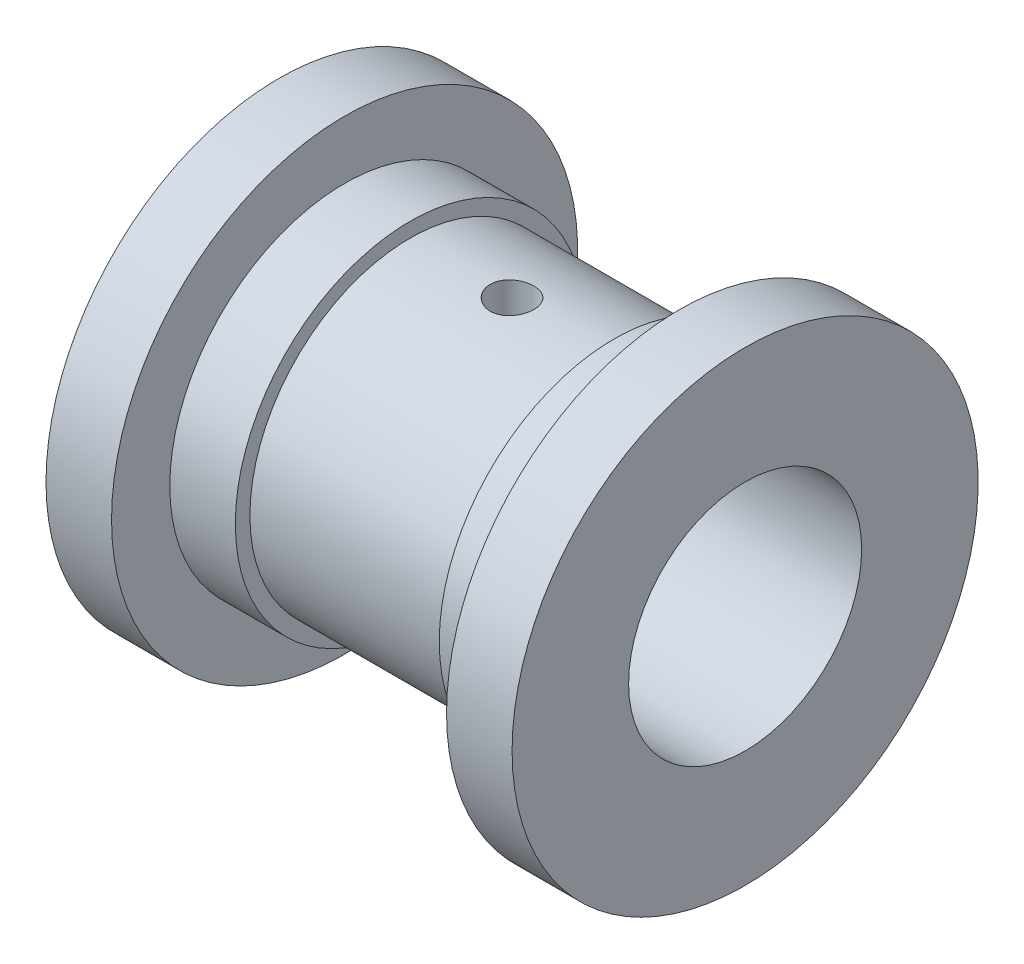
ISO-10303-21;
HEADER;
FILE_DESCRIPTION(('STEP AP214'),'2;1');
FILE_NAME('part.step','',(''),(''),'','','');
FILE_SCHEMA(('AUTOMOTIVE_DESIGN { 1 0 10303 214 1 1 1 1 }'));
ENDSEC;
DATA;
#1=APPLICATION_CONTEXT('core data for automotive mechanical design processes');
#2=APPLICATION_PROTOCOL_DEFINITION('international standard','automotive_design',2000,#1);
#3=PRODUCT_CONTEXT('',#1,'mechanical');
#4=PRODUCT('Part','Part','',(#3));
#5=PRODUCT_RELATED_PRODUCT_CATEGORY('part','',(#4));
#6=PRODUCT_DEFINITION_FORMATION('','',#4);
#7=PRODUCT_DEFINITION_CONTEXT('part definition',#1,'design');
#8=PRODUCT_DEFINITION('design','',#6,#7);
#9=PRODUCT_DEFINITION_SHAPE('','',#8);
#10=(LENGTH_UNIT() NAMED_UNIT(*) SI_UNIT(.MILLI.,.METRE.));
#11=(NAMED_UNIT(*) PLANE_ANGLE_UNIT() SI_UNIT($,.RADIAN.));
#12=(NAMED_UNIT(*) SI_UNIT($,.STERADIAN.) SOLID_ANGLE_UNIT());
#13=UNCERTAINTY_MEASURE_WITH_UNIT(LENGTH_MEASURE(1.E-05),#10,'distance_accuracy_value','');
#14=(GEOMETRIC_REPRESENTATION_CONTEXT(3) GLOBAL_UNCERTAINTY_ASSIGNED_CONTEXT((#13)) GLOBAL_UNIT_ASSIGNED_CONTEXT((#10,
#11,#12)) REPRESENTATION_CONTEXT('',''));
#15=CARTESIAN_POINT('',(0.,0.,0.));
#16=DIRECTION('',(0.,0.,1.));
#17=DIRECTION('',(1.,0.,0.));
#18=AXIS2_PLACEMENT_3D('',#15,#16,#17);
#19=CARTESIAN_POINT('',(-34.2236947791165,0.,0.));
#20=DIRECTION('',(-1.,0.,0.));
#21=DIRECTION('',(0.,0.,1.));
#22=AXIS2_PLACEMENT_3D('',#19,#20,#21);
#23=CYLINDRICAL_SURFACE('',#22,22.);
#24=CARTESIAN_POINT('',(0.,21.7944947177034,-3.));
#25=CARTESIAN_POINT('',(0.167668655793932,21.7944973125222,-2.99999295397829));
#26=CARTESIAN_POINT('',(0.335438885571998,21.7964504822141,-2.98589613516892));
#27=CARTESIAN_POINT('',(0.666300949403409,21.8040481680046,-2.92988930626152));
#28=CARTESIAN_POINT('',(0.829387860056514,21.8096964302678,-2.88795106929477));
#29=CARTESIAN_POINT('',(1.14604557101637,21.8240329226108,-2.77752885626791));
#30=CARTESIAN_POINT('',(1.29962310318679,21.8327189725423,-2.70906391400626));
#31=CARTESIAN_POINT('',(1.59308393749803,21.8521497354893,-2.54757436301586));
#32=CARTESIAN_POINT('',(1.73296937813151,21.8628941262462,-2.4545535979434));
#33=CARTESIAN_POINT('',(1.99602918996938,21.8853107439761,-2.24593261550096));
#34=CARTESIAN_POINT('',(2.11909952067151,21.8969880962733,-2.13020174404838));
#35=CARTESIAN_POINT('',(2.34413561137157,21.9199089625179,-1.87972745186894));
#36=CARTESIAN_POINT('',(2.44610027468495,21.9311524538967,-1.74498304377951));
#37=CARTESIAN_POINT('',(2.62640880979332,21.9519917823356,-1.45964673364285));
#38=CARTESIAN_POINT('',(2.70465775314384,21.9615809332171,-1.30899431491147));
#39=CARTESIAN_POINT('',(2.83470513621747,21.9779746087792,-0.996533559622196));
#40=CARTESIAN_POINT('',(2.88650473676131,21.9847792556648,-0.834725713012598));
#41=CARTESIAN_POINT('',(2.96187006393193,21.9948010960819,-0.505615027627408));
#42=CARTESIAN_POINT('',(2.98560939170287,21.9980403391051,-0.338352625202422));
#43=CARTESIAN_POINT('',(3.00471876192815,22.0006418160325,-0.00218901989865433));
#44=CARTESIAN_POINT('',(3.00009012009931,22.0000042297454,0.166712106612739));
#45=CARTESIAN_POINT('',(2.96273314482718,21.9949416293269,0.500176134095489));
#46=CARTESIAN_POINT('',(2.93019154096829,21.9905417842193,0.664760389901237));
#47=CARTESIAN_POINT('',(2.83822479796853,21.9784771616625,0.986109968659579));
#48=CARTESIAN_POINT('',(2.77879906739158,21.9708123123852,1.1428751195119));
#49=CARTESIAN_POINT('',(2.63455559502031,21.9530355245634,1.44470900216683));
#50=CARTESIAN_POINT('',(2.54965799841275,21.9429159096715,1.58973910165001));
#51=CARTESIAN_POINT('',(2.35693890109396,21.9213599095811,1.86356465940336));
#52=CARTESIAN_POINT('',(2.24911615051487,21.9099234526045,1.99235923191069));
#53=CARTESIAN_POINT('',(2.01256398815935,21.8869019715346,2.23115639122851));
#54=CARTESIAN_POINT('',(1.88367170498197,21.8753164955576,2.34099765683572));
#55=CARTESIAN_POINT('',(1.60919608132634,21.8533940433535,2.53751386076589));
#56=CARTESIAN_POINT('',(1.46361266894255,21.8430570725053,2.62418869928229));
#57=CARTESIAN_POINT('',(1.15973309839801,21.8248023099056,2.77192629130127));
#58=CARTESIAN_POINT('',(1.00142980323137,21.816885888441,2.83297454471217));
#59=CARTESIAN_POINT('',(0.676685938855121,21.8043941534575,2.92757469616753));
#60=CARTESIAN_POINT('',(0.510245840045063,21.7998186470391,2.96112818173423));
#61=CARTESIAN_POINT('',(0.175382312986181,21.7945626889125,2.99956941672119));
#62=CARTESIAN_POINT('',(0.00698549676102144,21.7938512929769,3.00468490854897));
#63=CARTESIAN_POINT('',(-0.32826283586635,21.7963221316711,2.98670732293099));
#64=CARTESIAN_POINT('',(-0.495114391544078,21.7995042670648,2.96361496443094));
#65=CARTESIAN_POINT('',(-0.821843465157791,21.8093753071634,2.89006955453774));
#66=CARTESIAN_POINT('',(-0.981746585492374,21.8160498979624,2.83972815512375));
#67=CARTESIAN_POINT('',(-1.29084344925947,21.8321421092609,2.71322912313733));
#68=CARTESIAN_POINT('',(-1.44003674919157,21.8415598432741,2.63707042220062));
#69=CARTESIAN_POINT('',(-1.72450521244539,21.8621508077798,2.46054424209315));
#70=CARTESIAN_POINT('',(-1.85968743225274,21.8733346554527,2.36002824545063));
#71=CARTESIAN_POINT('',(-2.11134500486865,21.8961649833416,2.13784918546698));
#72=CARTESIAN_POINT('',(-2.22781948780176,21.9078114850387,2.01618513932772));
#73=CARTESIAN_POINT('',(-2.43956305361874,21.9303506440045,1.75416517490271));
#74=CARTESIAN_POINT('',(-2.53468192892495,21.9412376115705,1.61368731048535));
#75=CARTESIAN_POINT('',(-2.6999717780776,21.9609445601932,1.31861563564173));
#76=CARTESIAN_POINT('',(-2.77014333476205,21.9697645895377,1.1640221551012));
#77=CARTESIAN_POINT('',(-2.88330205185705,21.9843187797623,0.845593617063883));
#78=CARTESIAN_POINT('',(-2.92637398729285,21.9900625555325,0.681789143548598));
#79=CARTESIAN_POINT('',(-2.98438601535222,21.9978571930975,0.349189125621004));
#80=CARTESIAN_POINT('',(-2.99932763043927,21.9999082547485,0.180393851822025));
#81=CARTESIAN_POINT('',(-3.00062266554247,22.0000849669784,-0.155933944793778));
#82=CARTESIAN_POINT('',(-2.98720691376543,21.9982423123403,-0.323465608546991));
#83=CARTESIAN_POINT('',(-2.93265946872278,21.9909020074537,-0.653868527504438));
#84=CARTESIAN_POINT('',(-2.89152782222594,21.9854043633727,-0.816739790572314));
#85=CARTESIAN_POINT('',(-2.78279281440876,21.9713688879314,-1.13315387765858));
#86=CARTESIAN_POINT('',(-2.71520266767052,21.9628325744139,-1.28670131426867));
#87=CARTESIAN_POINT('',(-2.55549339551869,21.9436616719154,-1.58031159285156));
#88=CARTESIAN_POINT('',(-2.46337375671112,21.9330270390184,-1.72037415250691));
#89=CARTESIAN_POINT('',(-2.25637442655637,21.9107413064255,-1.98421472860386));
#90=CARTESIAN_POINT('',(-2.14132346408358,21.899082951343,-2.10785776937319));
#91=CARTESIAN_POINT('',(-1.89208624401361,21.8761200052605,-2.33416948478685));
#92=CARTESIAN_POINT('',(-1.75789548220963,21.864815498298,-2.43683320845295));
#93=CARTESIAN_POINT('',(-1.47347030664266,21.8437846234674,-2.61868613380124));
#94=CARTESIAN_POINT('',(-1.32316490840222,21.8340657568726,-2.69776514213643));
#95=CARTESIAN_POINT('',(-1.01135241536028,21.817394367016,-2.8294429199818));
#96=CARTESIAN_POINT('',(-0.84985747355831,21.8104388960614,-2.8820699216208));
#97=CARTESIAN_POINT('',(-0.572977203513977,21.8017355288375,-2.94703203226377));
#98=CARTESIAN_POINT('',(-0.459323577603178,21.7990341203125,-2.96686567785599));
#99=CARTESIAN_POINT('',(-0.230462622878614,21.7954128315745,-2.99335201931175));
#100=CARTESIAN_POINT('',(-0.115255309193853,21.7944929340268,-3.00000484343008));
#101=CARTESIAN_POINT('',(0.,21.7944947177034,-3.));
#102=B_SPLINE_CURVE_WITH_KNOTS('',3,(#24,#25,#26,#27,#28,#29,#30,#31,#32,#33,#34,#35,#36,#37,
#38,#39,#40,#41,#42,#43,#44,#45,#46,#47,#48,#49,#50,#51,#52,#53,#54,#55,#56,#57,#58,#59,#60,#61,
#62,#63,#64,#65,#66,#67,#68,#69,#70,#71,#72,#73,#74,#75,#76,#77,#78,#79,#80,#81,#82,#83,#84,#85,
#86,#87,#88,#89,#90,#91,#92,#93,#94,#95,#96,#97,#98,#99,#100,#101),.UNSPECIFIED.,.T.,.F.,(4,2,2,
2,2,2,2,2,2,2,2,2,2,2,2,2,2,2,2,2,2,2,2,2,2,2,2,2,2,2,2,2,2,2,2,2,2,2,4),(0.,0.502584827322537,
1.00567997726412,1.50841480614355,2.01107098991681,2.5167086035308,3.02237248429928,
3.5300344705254,4.03767417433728,4.54215653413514,5.04661549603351,5.54772586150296,
6.04884725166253,6.55155638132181,7.05429292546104,7.56111742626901,8.06794411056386,
8.57505718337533,9.08214097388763,9.58515792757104,10.0881620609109,10.5891205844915,
11.0900998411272,11.5942142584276,12.0983521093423,12.6059319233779,13.1134998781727,
13.6194720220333,14.125416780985,14.6272590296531,15.1291004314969,15.6306915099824,
16.1322930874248,16.6377918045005,17.1434096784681,17.6513541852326,18.158755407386,
18.5042352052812,18.8497116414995),.UNSPECIFIED.);
#103=CARTESIAN_POINT('',(0.,21.7944947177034,-3.));
#104=VERTEX_POINT('',#103);
#105=EDGE_CURVE('E84',#104,#104,#102,.T.);
#106=ORIENTED_EDGE('',*,*,#105,.T.);
#107=EDGE_LOOP('',(#106));
#108=FACE_BOUND('',#107,.T.);
#109=CARTESIAN_POINT('',(14.,0.,0.));
#110=DIRECTION('',(-1.,0.,0.));
#111=DIRECTION('',(0.,0.,1.));
#112=AXIS2_PLACEMENT_3D('',#109,#110,#111);
#113=CIRCLE('',#112,22.);
#114=CARTESIAN_POINT('',(14.,0.,22.));
#115=VERTEX_POINT('',#114);
#116=EDGE_CURVE('E57',#115,#115,#113,.T.);
#117=ORIENTED_EDGE('',*,*,#116,.T.);
#118=EDGE_LOOP('',(#117));
#119=FACE_BOUND('',#118,.T.);
#120=CARTESIAN_POINT('',(-14.,0.,0.));
#121=DIRECTION('',(-1.,0.,0.));
#122=DIRECTION('',(0.,0.,1.));
#123=AXIS2_PLACEMENT_3D('',#120,#121,#122);
#124=CIRCLE('',#123,22.);
#125=CARTESIAN_POINT('',(-14.,0.,22.));
#126=VERTEX_POINT('',#125);
#127=EDGE_CURVE('E54',#126,#126,#124,.T.);
#128=ORIENTED_EDGE('',*,*,#127,.F.);
#129=EDGE_LOOP('',(#128));
#130=FACE_BOUND('',#129,.T.);
#131=CARTESIAN_POINT('',(0.,-21.6333076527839,-4.));
#132=CARTESIAN_POINT('',(0.22268024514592,-21.6333118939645,-3.99999133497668));
#133=CARTESIAN_POINT('',(0.445474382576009,-21.636783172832,-3.98134200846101));
#134=CARTESIAN_POINT('',(0.884789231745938,-21.650277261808,-3.907282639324));
#135=CARTESIAN_POINT('',(1.10130431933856,-21.6603057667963,-3.85184064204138));
#136=CARTESIAN_POINT('',(1.52164062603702,-21.6857418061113,-3.70594738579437));
#137=CARTESIAN_POINT('',(1.7254731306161,-21.7011444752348,-3.61552778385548));
#138=CARTESIAN_POINT('',(2.11505978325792,-21.7355875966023,-3.40232850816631));
#139=CARTESIAN_POINT('',(2.30081551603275,-21.7546277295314,-3.27955167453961));
#140=CARTESIAN_POINT('',(2.65116689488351,-21.7944494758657,-3.00359049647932));
#141=CARTESIAN_POINT('',(2.8155201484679,-21.8152472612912,-2.85010070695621));
#142=CARTESIAN_POINT('',(3.11629112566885,-21.8560978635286,-2.51773079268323));
#143=CARTESIAN_POINT('',(3.25270706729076,-21.8761506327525,-2.338849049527));
#144=CARTESIAN_POINT('',(3.49465463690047,-21.9134244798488,-1.95918683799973));
#145=CARTESIAN_POINT('',(3.59995853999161,-21.930624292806,-1.75825898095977));
#146=CARTESIAN_POINT('',(3.77522666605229,-21.9600735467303,-1.34119954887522));
#147=CARTESIAN_POINT('',(3.84519362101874,-21.9723233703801,-1.12506915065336));
#148=CARTESIAN_POINT('',(3.94705446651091,-21.9903782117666,-0.686249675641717));
#149=CARTESIAN_POINT('',(3.97935662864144,-21.9962522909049,-0.463658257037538));
#150=CARTESIAN_POINT('',(4.0062423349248,-22.0011316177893,-0.0161429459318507));
#151=CARTESIAN_POINT('',(4.00082890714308,-22.0001374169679,0.208780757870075));
#152=CARTESIAN_POINT('',(3.95275171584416,-21.9914463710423,0.651778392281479));
#153=CARTESIAN_POINT('',(3.91052749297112,-21.9838286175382,0.869901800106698));
#154=CARTESIAN_POINT('',(3.79072160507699,-21.9628349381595,1.29591498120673));
#155=CARTESIAN_POINT('',(3.71313870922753,-21.949458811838,1.5038043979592));
#156=CARTESIAN_POINT('',(3.52439388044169,-21.9183184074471,1.90473245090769));
#157=CARTESIAN_POINT('',(3.41305471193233,-21.9005310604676,2.09768578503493));
#158=CARTESIAN_POINT('',(3.16008822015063,-21.8625379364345,2.46233526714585));
#159=CARTESIAN_POINT('',(3.01845799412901,-21.8423319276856,2.63402937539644));
#160=CARTESIAN_POINT('',(2.70650309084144,-21.8013981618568,2.95388890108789));
#161=CARTESIAN_POINT('',(2.53579396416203,-21.7806670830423,3.10167918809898));
#162=CARTESIAN_POINT('',(2.17181187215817,-21.7412992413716,3.36658543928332));
#163=CARTESIAN_POINT('',(1.97853861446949,-21.7226625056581,3.48370100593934));
#164=CARTESIAN_POINT('',(1.57443497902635,-21.6895894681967,3.68403076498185));
#165=CARTESIAN_POINT('',(1.36357833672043,-21.6751596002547,3.76719310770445));
#166=CARTESIAN_POINT('',(0.930565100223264,-21.6522346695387,3.89680753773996));
#167=CARTESIAN_POINT('',(0.708409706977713,-21.6437389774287,3.94326351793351));
#168=CARTESIAN_POINT('',(0.262480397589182,-21.6337680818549,3.99760435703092));
#169=CARTESIAN_POINT('',(0.0387741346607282,-21.6321950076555,4.00602696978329));
#170=CARTESIAN_POINT('',(-0.40684910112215,-21.6359859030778,3.98550109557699));
#171=CARTESIAN_POINT('',(-0.628766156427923,-21.6413495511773,3.95655434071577));
#172=CARTESIAN_POINT('',(-1.06276068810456,-21.6583185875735,3.86257219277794));
#173=CARTESIAN_POINT('',(-1.27490076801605,-21.6698756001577,3.79781637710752));
#174=CARTESIAN_POINT('',(-1.68531943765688,-21.6978878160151,3.63434995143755));
#175=CARTESIAN_POINT('',(-1.88359705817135,-21.7143433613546,3.53563697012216));
#176=CARTESIAN_POINT('',(-2.26303839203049,-21.7505226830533,3.30581172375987));
#177=CARTESIAN_POINT('',(-2.44399223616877,-21.7702800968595,3.17435835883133));
#178=CARTESIAN_POINT('',(-2.78146738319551,-21.8107413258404,2.88324609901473));
#179=CARTESIAN_POINT('',(-2.93798662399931,-21.8314452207,2.72358482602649));
#180=CARTESIAN_POINT('',(-3.22414569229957,-21.8717797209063,2.37819260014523));
#181=CARTESIAN_POINT('',(-3.3534247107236,-21.8913936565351,2.19216046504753));
#182=CARTESIAN_POINT('',(-3.57889261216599,-21.9270616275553,1.80070523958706));
#183=CARTESIAN_POINT('',(-3.67508271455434,-21.9431157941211,1.5952828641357));
#184=CARTESIAN_POINT('',(-3.83109607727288,-21.9697834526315,1.17189643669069));
#185=CARTESIAN_POINT('',(-3.89109980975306,-21.9804239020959,0.954000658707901));
#186=CARTESIAN_POINT('',(-3.97361468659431,-21.9951799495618,0.511013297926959));
#187=CARTESIAN_POINT('',(-3.99612953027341,-21.9992961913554,0.285922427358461));
#188=CARTESIAN_POINT('',(-4.00290504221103,-22.0005282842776,-0.161599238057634));
#189=CARTESIAN_POINT('',(-3.98771177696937,-21.9977440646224,-0.384021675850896));
#190=CARTESIAN_POINT('',(-3.92069410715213,-21.9856946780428,-0.823089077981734));
#191=CARTESIAN_POINT('',(-3.86887000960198,-21.9764295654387,-1.03973409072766));
#192=CARTESIAN_POINT('',(-3.73028619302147,-21.9524581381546,-1.46083086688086));
#193=CARTESIAN_POINT('',(-3.64358130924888,-21.9377603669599,-1.6653011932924));
#194=CARTESIAN_POINT('',(-3.43776119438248,-21.9045184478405,-2.05687402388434));
#195=CARTESIAN_POINT('',(-3.31864396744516,-21.8859740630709,-2.24397545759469));
#196=CARTESIAN_POINT('',(-3.04948472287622,-21.8467718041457,-2.59822919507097));
#197=CARTESIAN_POINT('',(-2.89904660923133,-21.826088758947,-2.76507779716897));
#198=CARTESIAN_POINT('',(-2.57234096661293,-21.7851034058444,-3.07135244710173));
#199=CARTESIAN_POINT('',(-2.39606738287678,-21.7648011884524,-3.21077204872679));
#200=CARTESIAN_POINT('',(-2.02088064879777,-21.7266856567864,-3.45935343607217));
#201=CARTESIAN_POINT('',(-1.8217855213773,-21.7088952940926,-3.56824417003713));
#202=CARTESIAN_POINT('',(-1.40787344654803,-21.6780923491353,-3.75086117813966));
#203=CARTESIAN_POINT('',(-1.19307181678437,-21.6650751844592,-3.82462119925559));
#204=CARTESIAN_POINT('',(-0.814646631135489,-21.6480562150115,-3.91959792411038));
#205=CARTESIAN_POINT('',(-0.65326147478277,-21.642557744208,-3.94969798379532));
#206=CARTESIAN_POINT('',(-0.327938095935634,-21.6351819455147,-3.98990196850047));
#207=CARTESIAN_POINT('',(-0.163999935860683,-21.6333045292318,-4.00000638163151));
#208=CARTESIAN_POINT('',(0.,-21.6333076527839,-4.));
#209=B_SPLINE_CURVE_WITH_KNOTS('',3,(#131,#132,#133,#134,#135,#136,#137,#138,#139,#140,#141,
#142,#143,#144,#145,#146,#147,#148,#149,#150,#151,#152,#153,#154,#155,#156,#157,#158,#159,#160,
#161,#162,#163,#164,#165,#166,#167,#168,#169,#170,#171,#172,#173,#174,#175,#176,#177,#178,#179,
#180,#181,#182,#183,#184,#185,#186,#187,#188,#189,#190,#191,#192,#193,#194,#195,#196,#197,#198,
#199,#200,#201,#202,#203,#204,#205,#206,#207,#208),.UNSPECIFIED.,.T.,.F.,(4,2,2,2,2,2,2,2,2,2,2,
2,2,2,2,2,2,2,2,2,2,2,2,2,2,2,2,2,2,2,2,2,2,2,2,2,2,2,4),(0.,0.667440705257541,1.33546184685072,
2.00287979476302,2.67023918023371,3.34459870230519,4.01900122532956,4.69822425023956,
5.37739475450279,6.04913278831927,6.7208168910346,7.38458890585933,8.04838402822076,
8.71572656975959,9.38313309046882,10.0601670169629,10.7372097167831,11.4152824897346,
12.0932833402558,12.7616672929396,13.4300202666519,14.0932273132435,14.7564806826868,
15.4269564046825,16.0974886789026,16.7764104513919,17.4553072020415,18.1307894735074,
18.8062050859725,19.4718969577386,20.1375832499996,20.8022270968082,21.4669118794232,
22.1405775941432,22.8144014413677,23.4940309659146,24.1730063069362,24.6645762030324,
25.1561340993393),.UNSPECIFIED.);
#210=CARTESIAN_POINT('',(0.,-21.6333076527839,-4.));
#211=VERTEX_POINT('',#210);
#212=EDGE_CURVE('E10',#211,#211,#209,.T.);
#213=ORIENTED_EDGE('',*,*,#212,.F.);
#214=EDGE_LOOP('',(#213));
#215=FACE_BOUND('',#214,.T.);
#216=ADVANCED_FACE('F30',(#108,#119,#130,#215),#23,.T.);
#217=CARTESIAN_POINT('',(-34.2236947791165,0.,0.));
#218=DIRECTION('',(-1.,0.,0.));
#219=DIRECTION('',(0.,0.,1.));
#220=AXIS2_PLACEMENT_3D('',#217,#218,#219);
#221=CYLINDRICAL_SURFACE('',#220,32.);
#222=CARTESIAN_POINT('',(-32.,0.,0.));
#223=DIRECTION('',(-1.,0.,0.));
#224=DIRECTION('',(0.,0.,1.));
#225=AXIS2_PLACEMENT_3D('',#222,#223,#224);
#226=CIRCLE('',#225,32.);
#227=CARTESIAN_POINT('',(-32.,0.,32.));
#228=VERTEX_POINT('',#227);
#229=EDGE_CURVE('E78',#228,#228,#226,.T.);
#230=ORIENTED_EDGE('',*,*,#229,.F.);
#231=EDGE_LOOP('',(#230));
#232=FACE_BOUND('',#231,.T.);
#233=CARTESIAN_POINT('',(-23.,0.,0.));
#234=DIRECTION('',(-1.,0.,0.));
#235=DIRECTION('',(0.,0.,1.));
#236=AXIS2_PLACEMENT_3D('',#233,#234,#235);
#237=CIRCLE('',#236,32.);
#238=CARTESIAN_POINT('',(-23.,0.,32.));
#239=VERTEX_POINT('',#238);
#240=EDGE_CURVE('E41',#239,#239,#237,.T.);
#241=ORIENTED_EDGE('',*,*,#240,.T.);
#242=EDGE_LOOP('',(#241));
#243=FACE_BOUND('',#242,.T.);
#244=ADVANCED_FACE('F32',(#232,#243),#221,.T.);
#245=CARTESIAN_POINT('',(-23.,32.,0.));
#246=DIRECTION('',(-1.,0.,0.));
#247=DIRECTION('',(0.,0.,1.));
#248=AXIS2_PLACEMENT_3D('',#245,#246,#247);
#249=PLANE('',#248);
#250=ORIENTED_EDGE('',*,*,#240,.F.);
#251=EDGE_LOOP('',(#250));
#252=FACE_BOUND('',#251,.T.);
#253=CARTESIAN_POINT('',(-23.,0.,0.));
#254=DIRECTION('',(-1.,0.,0.));
#255=DIRECTION('',(0.,0.,1.));
#256=AXIS2_PLACEMENT_3D('',#253,#254,#255);
#257=CIRCLE('',#256,24.);
#258=CARTESIAN_POINT('',(-23.,0.,24.));
#259=VERTEX_POINT('',#258);
#260=EDGE_CURVE('E45',#259,#259,#257,.T.);
#261=ORIENTED_EDGE('',*,*,#260,.T.);
#262=EDGE_LOOP('',(#261));
#263=FACE_BOUND('',#262,.T.);
#264=ADVANCED_FACE('F152',(#252,#263),#249,.F.);
#265=CARTESIAN_POINT('',(-34.2236947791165,0.,0.));
#266=DIRECTION('',(-1.,0.,0.));
#267=DIRECTION('',(0.,0.,1.));
#268=AXIS2_PLACEMENT_3D('',#265,#266,#267);
#269=CYLINDRICAL_SURFACE('',#268,24.);
#270=ORIENTED_EDGE('',*,*,#260,.F.);
#271=EDGE_LOOP('',(#270));
#272=FACE_BOUND('',#271,.T.);
#273=CARTESIAN_POINT('',(-14.,0.,0.));
#274=DIRECTION('',(-1.,0.,0.));
#275=DIRECTION('',(0.,0.,1.));
#276=AXIS2_PLACEMENT_3D('',#273,#274,#275);
#277=CIRCLE('',#276,24.);
#278=CARTESIAN_POINT('',(-14.,0.,24.));
#279=VERTEX_POINT('',#278);
#280=EDGE_CURVE('E49',#279,#279,#277,.T.);
#281=ORIENTED_EDGE('',*,*,#280,.T.);
#282=EDGE_LOOP('',(#281));
#283=FACE_BOUND('',#282,.T.);
#284=ADVANCED_FACE('F143',(#272,#283),#269,.T.);
#285=CARTESIAN_POINT('',(-14.,24.,0.));
#286=DIRECTION('',(-1.,0.,0.));
#287=DIRECTION('',(0.,0.,1.));
#288=AXIS2_PLACEMENT_3D('',#285,#286,#287);
#289=PLANE('',#288);
#290=ORIENTED_EDGE('',*,*,#280,.F.);
#291=EDGE_LOOP('',(#290));
#292=FACE_BOUND('',#291,.T.);
#293=ORIENTED_EDGE('',*,*,#127,.T.);
#294=EDGE_LOOP('',(#293));
#295=FACE_BOUND('',#294,.T.);
#296=ADVANCED_FACE('F138',(#292,#295),#289,.F.);
#297=CARTESIAN_POINT('',(14.,24.,0.));
#298=DIRECTION('',(1.,0.,0.));
#299=DIRECTION('',(0.,0.,-1.));
#300=AXIS2_PLACEMENT_3D('',#297,#298,#299);
#301=PLANE('',#300);
#302=ORIENTED_EDGE('',*,*,#116,.F.);
#303=EDGE_LOOP('',(#302));
#304=FACE_BOUND('',#303,.T.);
#305=CARTESIAN_POINT('',(14.,0.,0.));
#306=DIRECTION('',(-1.,0.,0.));
#307=DIRECTION('',(0.,0.,1.));
#308=AXIS2_PLACEMENT_3D('',#305,#306,#307);
#309=CIRCLE('',#308,24.);
#310=CARTESIAN_POINT('',(14.,0.,24.));
#311=VERTEX_POINT('',#310);
#312=EDGE_CURVE('E60',#311,#311,#309,.T.);
#313=ORIENTED_EDGE('',*,*,#312,.T.);
#314=EDGE_LOOP('',(#313));
#315=FACE_BOUND('',#314,.T.);
#316=ADVANCED_FACE('F135',(#304,#315),#301,.F.);
#317=CARTESIAN_POINT('',(-34.2236947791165,0.,0.));
#318=DIRECTION('',(-1.,0.,0.));
#319=DIRECTION('',(0.,0.,1.));
#320=AXIS2_PLACEMENT_3D('',#317,#318,#319);
#321=CYLINDRICAL_SURFACE('',#320,24.);
#322=ORIENTED_EDGE('',*,*,#312,.F.);
#323=EDGE_LOOP('',(#322));
#324=FACE_BOUND('',#323,.T.);
#325=CARTESIAN_POINT('',(23.,0.,0.));
#326=DIRECTION('',(-1.,0.,0.));
#327=DIRECTION('',(0.,0.,1.));
#328=AXIS2_PLACEMENT_3D('',#325,#326,#327);
#329=CIRCLE('',#328,24.);
#330=CARTESIAN_POINT('',(23.,0.,24.));
#331=VERTEX_POINT('',#330);
#332=EDGE_CURVE('E63',#331,#331,#329,.T.);
#333=ORIENTED_EDGE('',*,*,#332,.T.);
#334=EDGE_LOOP('',(#333));
#335=FACE_BOUND('',#334,.T.);
#336=ADVANCED_FACE('F132',(#324,#335),#321,.T.);
#337=CARTESIAN_POINT('',(23.,32.,0.));
#338=DIRECTION('',(1.,0.,0.));
#339=DIRECTION('',(0.,0.,-1.));
#340=AXIS2_PLACEMENT_3D('',#337,#338,#339);
#341=PLANE('',#340);
#342=ORIENTED_EDGE('',*,*,#332,.F.);
#343=EDGE_LOOP('',(#342));
#344=FACE_BOUND('',#343,.T.);
#345=CARTESIAN_POINT('',(23.,0.,0.));
#346=DIRECTION('',(-1.,0.,0.));
#347=DIRECTION('',(0.,0.,1.));
#348=AXIS2_PLACEMENT_3D('',#345,#346,#347);
#349=CIRCLE('',#348,32.);
#350=CARTESIAN_POINT('',(23.,0.,32.));
#351=VERTEX_POINT('',#350);
#352=EDGE_CURVE('E66',#351,#351,#349,.T.);
#353=ORIENTED_EDGE('',*,*,#352,.T.);
#354=EDGE_LOOP('',(#353));
#355=FACE_BOUND('',#354,.T.);
#356=ADVANCED_FACE('F128',(#344,#355),#341,.F.);
#357=CARTESIAN_POINT('',(-34.2236947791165,0.,0.));
#358=DIRECTION('',(-1.,0.,0.));
#359=DIRECTION('',(0.,0.,1.));
#360=AXIS2_PLACEMENT_3D('',#357,#358,#359);
#361=CYLINDRICAL_SURFACE('',#360,32.);
#362=ORIENTED_EDGE('',*,*,#352,.F.);
#363=EDGE_LOOP('',(#362));
#364=FACE_BOUND('',#363,.T.);
#365=CARTESIAN_POINT('',(32.,0.,0.));
#366=DIRECTION('',(-1.,0.,0.));
#367=DIRECTION('',(0.,0.,1.));
#368=AXIS2_PLACEMENT_3D('',#365,#366,#367);
#369=CIRCLE('',#368,32.);
#370=CARTESIAN_POINT('',(32.,0.,32.));
#371=VERTEX_POINT('',#370);
#372=EDGE_CURVE('E69',#371,#371,#369,.T.);
#373=ORIENTED_EDGE('',*,*,#372,.T.);
#374=EDGE_LOOP('',(#373));
#375=FACE_BOUND('',#374,.T.);
#376=ADVANCED_FACE('F124',(#364,#375),#361,.T.);
#377=CARTESIAN_POINT('',(32.,16.,0.));
#378=DIRECTION('',(-1.,0.,0.));
#379=DIRECTION('',(0.,0.,1.));
#380=AXIS2_PLACEMENT_3D('',#377,#378,#379);
#381=PLANE('',#380);
#382=ORIENTED_EDGE('',*,*,#372,.F.);
#383=EDGE_LOOP('',(#382));
#384=FACE_BOUND('',#383,.T.);
#385=CARTESIAN_POINT('',(32.,0.,0.));
#386=DIRECTION('',(-1.,0.,0.));
#387=DIRECTION('',(0.,0.,1.));
#388=AXIS2_PLACEMENT_3D('',#385,#386,#387);
#389=CIRCLE('',#388,16.);
#390=CARTESIAN_POINT('',(32.,0.,16.));
#391=VERTEX_POINT('',#390);
#392=EDGE_CURVE('E72',#391,#391,#389,.T.);
#393=ORIENTED_EDGE('',*,*,#392,.T.);
#394=EDGE_LOOP('',(#393));
#395=FACE_BOUND('',#394,.T.);
#396=ADVANCED_FACE('F119',(#384,#395),#381,.F.);
#397=CARTESIAN_POINT('',(-34.2236947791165,0.,0.));
#398=DIRECTION('',(-1.,0.,0.));
#399=DIRECTION('',(0.,0.,1.));
#400=AXIS2_PLACEMENT_3D('',#397,#398,#399);
#401=CYLINDRICAL_SURFACE('',#400,16.);
#402=CARTESIAN_POINT('',(0.,15.7162336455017,-3.));
#403=CARTESIAN_POINT('',(-0.166914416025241,15.7162368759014,-2.99999359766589));
#404=CARTESIAN_POINT('',(-0.333911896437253,15.7189215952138,-2.98602252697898));
#405=CARTESIAN_POINT('',(-0.663197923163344,15.7293570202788,-2.93054506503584));
#406=CARTESIAN_POINT('',(-0.825482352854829,15.7371120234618,-2.88901531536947));
#407=CARTESIAN_POINT('',(-1.14053014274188,15.7567795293,-2.77974071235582));
#408=CARTESIAN_POINT('',(-1.29330221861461,15.7686881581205,-2.7120202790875));
#409=CARTESIAN_POINT('',(-1.58530711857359,15.7953165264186,-2.5523513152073));
#410=CARTESIAN_POINT('',(-1.72454099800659,15.8100360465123,-2.46040467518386));
#411=CARTESIAN_POINT('',(-1.98726039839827,15.8408322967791,-2.25367357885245));
#412=CARTESIAN_POINT('',(-2.11055296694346,15.8569223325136,-2.13864585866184));
#413=CARTESIAN_POINT('',(-2.33620877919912,15.8885291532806,-1.8895435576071));
#414=CARTESIAN_POINT('',(-2.43857064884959,15.904045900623,-1.75546772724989));
#415=CARTESIAN_POINT('',(-2.62019875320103,15.9329003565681,-1.47080778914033));
#416=CARTESIAN_POINT('',(-2.69928306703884,15.9462205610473,-1.32010568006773));
#417=CARTESIAN_POINT('',(-2.83093908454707,15.9690321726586,-1.00726256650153));
#418=CARTESIAN_POINT('',(-2.88351296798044,15.9785238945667,-0.845122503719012));
#419=CARTESIAN_POINT('',(-2.96005909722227,15.9925151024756,-0.516005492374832));
#420=CARTESIAN_POINT('',(-2.98435661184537,15.9970713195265,-0.349106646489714));
#421=CARTESIAN_POINT('',(-3.0046737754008,16.0008736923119,-0.013543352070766));
#422=CARTESIAN_POINT('',(-3.00069583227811,16.0001203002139,0.155120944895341));
#423=CARTESIAN_POINT('',(-2.9648244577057,15.9934326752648,0.487196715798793));
#424=CARTESIAN_POINT('',(-2.93328126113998,15.9875634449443,0.650647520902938));
#425=CARTESIAN_POINT('',(-2.84372870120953,15.9713765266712,0.969894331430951));
#426=CARTESIAN_POINT('',(-2.78571837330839,15.9610586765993,1.12569005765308));
#427=CARTESIAN_POINT('',(-2.6445445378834,15.9370252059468,1.42622013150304));
#428=CARTESIAN_POINT('',(-2.56124102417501,15.9232907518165,1.57088714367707));
#429=CARTESIAN_POINT('',(-2.37194866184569,15.893942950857,1.84431995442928));
#430=CARTESIAN_POINT('',(-2.26595750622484,15.8783294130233,1.97308413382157));
#431=CARTESIAN_POINT('',(-2.03236859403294,15.8466702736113,2.21313123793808));
#432=CARTESIAN_POINT('',(-1.90446443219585,15.8306217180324,2.32411581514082));
#433=CARTESIAN_POINT('',(-1.63170093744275,15.8001301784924,2.52310343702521));
#434=CARTESIAN_POINT('',(-1.48684135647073,15.785687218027,2.61110614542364));
#435=CARTESIAN_POINT('',(-1.18388345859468,15.7600378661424,2.76171704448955));
#436=CARTESIAN_POINT('',(-1.02576308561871,15.7488370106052,2.82428187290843));
#437=CARTESIAN_POINT('',(-0.700997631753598,15.7310248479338,2.92187313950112));
#438=CARTESIAN_POINT('',(-0.534353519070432,15.7244130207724,2.95690269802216));
#439=CARTESIAN_POINT('',(-0.199961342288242,15.7166304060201,2.99799345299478));
#440=CARTESIAN_POINT('',(-0.03226776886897,15.7153791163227,3.00448328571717));
#441=CARTESIAN_POINT('',(0.301806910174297,15.7182438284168,2.98945937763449));
#442=CARTESIAN_POINT('',(0.468188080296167,15.7223595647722,2.96794702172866));
#443=CARTESIAN_POINT('',(0.793505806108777,15.7354196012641,2.89789736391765));
#444=CARTESIAN_POINT('',(0.952492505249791,15.7443237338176,2.84958477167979));
#445=CARTESIAN_POINT('',(1.26011437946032,15.7659226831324,2.7275444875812));
#446=CARTESIAN_POINT('',(1.40874879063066,15.7786177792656,2.6538149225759));
#447=CARTESIAN_POINT('',(1.69333523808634,15.8065515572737,2.4820470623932));
#448=CARTESIAN_POINT('',(1.82912107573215,15.8218179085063,2.38373799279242));
#449=CARTESIAN_POINT('',(2.08242408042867,15.853096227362,2.16596688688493));
#450=CARTESIAN_POINT('',(2.19993960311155,15.8691082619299,2.04650294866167));
#451=CARTESIAN_POINT('',(2.41496752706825,15.9003324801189,1.78789883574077));
#452=CARTESIAN_POINT('',(2.51219165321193,15.9155311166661,1.64851706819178));
#453=CARTESIAN_POINT('',(2.68184241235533,15.943188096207,1.35514904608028));
#454=CARTESIAN_POINT('',(2.75427000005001,15.9556465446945,1.20116335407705));
#455=CARTESIAN_POINT('',(2.87184019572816,15.9763611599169,0.883755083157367));
#456=CARTESIAN_POINT('',(2.91712437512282,15.9846390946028,0.720386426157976));
#457=CARTESIAN_POINT('',(2.97957409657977,15.9961528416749,0.388192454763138));
#458=CARTESIAN_POINT('',(2.99674259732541,15.9993891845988,0.219367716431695));
#459=CARTESIAN_POINT('',(3.0023706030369,16.0004445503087,-0.116181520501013));
#460=CARTESIAN_POINT('',(2.9912655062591,15.9983457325,-0.282898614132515));
#461=CARTESIAN_POINT('',(2.94161514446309,15.9891373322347,-0.612046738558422));
#462=CARTESIAN_POINT('',(2.90307014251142,15.9820277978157,-0.774477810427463));
#463=CARTESIAN_POINT('',(2.79981758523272,15.9635967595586,-1.09021295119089));
#464=CARTESIAN_POINT('',(2.73515637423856,15.9522827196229,-1.24353263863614));
#465=CARTESIAN_POINT('',(2.58155909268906,15.9266674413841,-1.5372112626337));
#466=CARTESIAN_POINT('',(2.49262139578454,15.912366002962,-1.67756933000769));
#467=CARTESIAN_POINT('',(2.29149709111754,15.882095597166,-1.94351005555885));
#468=CARTESIAN_POINT('',(2.17899593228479,15.8661056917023,-2.06885247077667));
#469=CARTESIAN_POINT('',(1.93459087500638,15.8343926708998,-2.2990307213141));
#470=CARTESIAN_POINT('',(1.80268241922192,15.8186696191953,-2.40386172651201));
#471=CARTESIAN_POINT('',(1.52174709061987,15.7891115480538,-2.59095267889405));
#472=CARTESIAN_POINT('',(1.37257312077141,15.7752953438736,-2.67299481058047));
#473=CARTESIAN_POINT('',(1.06234842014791,15.7513416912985,-2.81072264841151));
#474=CARTESIAN_POINT('',(0.901309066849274,15.7412007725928,-2.86643323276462));
#475=CARTESIAN_POINT('',(0.616495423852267,15.7278603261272,-2.9385945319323));
#476=CARTESIAN_POINT('',(0.494388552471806,15.7235262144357,-2.96158211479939));
#477=CARTESIAN_POINT('',(0.248203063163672,15.7177117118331,-2.99228702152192));
#478=CARTESIAN_POINT('',(0.124124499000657,15.7162312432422,-3.00000476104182));
#479=CARTESIAN_POINT('',(0.,15.7162336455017,-3.));
#480=B_SPLINE_CURVE_WITH_KNOTS('',3,(#402,#403,#404,#405,#406,#407,#408,#409,#410,#411,#412,
#413,#414,#415,#416,#417,#418,#419,#420,#421,#422,#423,#424,#425,#426,#427,#428,#429,#430,#431,
#432,#433,#434,#435,#436,#437,#438,#439,#440,#441,#442,#443,#444,#445,#446,#447,#448,#449,#450,
#451,#452,#453,#454,#455,#456,#457,#458,#459,#460,#461,#462,#463,#464,#465,#466,#467,#468,#469,
#470,#471,#472,#473,#474,#475,#476,#477,#478,#479),.UNSPECIFIED.,.T.,.F.,(4,2,2,2,2,2,2,2,2,2,2,
2,2,2,2,2,2,2,2,2,2,2,2,2,2,2,2,2,2,2,2,2,2,2,2,2,2,2,4),(0.,0.500289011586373,1.00100260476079,
1.50125045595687,2.00145927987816,2.50724671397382,3.01306734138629,3.52274208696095,
4.03237491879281,4.53608550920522,5.03975320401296,5.53711301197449,6.03449094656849,
6.53467383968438,7.03490761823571,7.54281229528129,8.050724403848,8.55949872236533,
9.06821537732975,9.5692649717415,10.0702897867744,10.5671758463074,11.0640985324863,
11.5667572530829,12.0694611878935,12.5788825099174,13.0882842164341,13.5950053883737,
14.1016732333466,14.6005860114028,15.0994940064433,15.5975205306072,16.0955804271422,
16.6007692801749,17.1060769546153,17.6160600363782,18.1255603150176,18.4976061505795,
18.8696418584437),.UNSPECIFIED.);
#481=CARTESIAN_POINT('',(0.,15.7162336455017,-3.));
#482=VERTEX_POINT('',#481);
#483=EDGE_CURVE('E90',#482,#482,#480,.T.);
#484=ORIENTED_EDGE('',*,*,#483,.T.);
#485=EDGE_LOOP('',(#484));
#486=FACE_BOUND('',#485,.T.);
#487=CARTESIAN_POINT('',(0.,-15.7162336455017,-3.));
#488=CARTESIAN_POINT('',(0.166914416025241,-15.7162368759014,-2.99999359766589));
#489=CARTESIAN_POINT('',(0.333911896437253,-15.7189215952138,-2.98602252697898));
#490=CARTESIAN_POINT('',(0.663197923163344,-15.7293570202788,-2.93054506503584));
#491=CARTESIAN_POINT('',(0.825482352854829,-15.7371120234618,-2.88901531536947));
#492=CARTESIAN_POINT('',(1.14053014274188,-15.7567795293,-2.77974071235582));
#493=CARTESIAN_POINT('',(1.29330221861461,-15.7686881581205,-2.7120202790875));
#494=CARTESIAN_POINT('',(1.58530711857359,-15.7953165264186,-2.5523513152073));
#495=CARTESIAN_POINT('',(1.72454099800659,-15.8100360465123,-2.46040467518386));
#496=CARTESIAN_POINT('',(1.98726039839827,-15.8408322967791,-2.25367357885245));
#497=CARTESIAN_POINT('',(2.11055296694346,-15.8569223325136,-2.13864585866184));
#498=CARTESIAN_POINT('',(2.33620877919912,-15.8885291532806,-1.8895435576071));
#499=CARTESIAN_POINT('',(2.43857064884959,-15.904045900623,-1.75546772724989));
#500=CARTESIAN_POINT('',(2.62019875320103,-15.9329003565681,-1.47080778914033));
#501=CARTESIAN_POINT('',(2.69928306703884,-15.9462205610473,-1.32010568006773));
#502=CARTESIAN_POINT('',(2.83093908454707,-15.9690321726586,-1.00726256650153));
#503=CARTESIAN_POINT('',(2.88351296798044,-15.9785238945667,-0.845122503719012));
#504=CARTESIAN_POINT('',(2.96005909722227,-15.9925151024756,-0.516005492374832));
#505=CARTESIAN_POINT('',(2.98435661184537,-15.9970713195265,-0.349106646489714));
#506=CARTESIAN_POINT('',(3.0046737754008,-16.0008736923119,-0.013543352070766));
#507=CARTESIAN_POINT('',(3.00069583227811,-16.0001203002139,0.155120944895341));
#508=CARTESIAN_POINT('',(2.9648244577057,-15.9934326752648,0.487196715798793));
#509=CARTESIAN_POINT('',(2.93328126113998,-15.9875634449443,0.650647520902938));
#510=CARTESIAN_POINT('',(2.84372870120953,-15.9713765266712,0.969894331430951));
#511=CARTESIAN_POINT('',(2.78571837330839,-15.9610586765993,1.12569005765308));
#512=CARTESIAN_POINT('',(2.6445445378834,-15.9370252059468,1.42622013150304));
#513=CARTESIAN_POINT('',(2.56124102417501,-15.9232907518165,1.57088714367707));
#514=CARTESIAN_POINT('',(2.37194866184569,-15.893942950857,1.84431995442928));
#515=CARTESIAN_POINT('',(2.26595750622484,-15.8783294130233,1.97308413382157));
#516=CARTESIAN_POINT('',(2.03236859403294,-15.8466702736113,2.21313123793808));
#517=CARTESIAN_POINT('',(1.90446443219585,-15.8306217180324,2.32411581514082));
#518=CARTESIAN_POINT('',(1.63170093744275,-15.8001301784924,2.52310343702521));
#519=CARTESIAN_POINT('',(1.48684135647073,-15.785687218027,2.61110614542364));
#520=CARTESIAN_POINT('',(1.18388345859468,-15.7600378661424,2.76171704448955));
#521=CARTESIAN_POINT('',(1.02576308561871,-15.7488370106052,2.82428187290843));
#522=CARTESIAN_POINT('',(0.700997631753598,-15.7310248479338,2.92187313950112));
#523=CARTESIAN_POINT('',(0.534353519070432,-15.7244130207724,2.95690269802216));
#524=CARTESIAN_POINT('',(0.199961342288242,-15.7166304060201,2.99799345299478));
#525=CARTESIAN_POINT('',(0.03226776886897,-15.7153791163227,3.00448328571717));
#526=CARTESIAN_POINT('',(-0.301806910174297,-15.7182438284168,2.98945937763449));
#527=CARTESIAN_POINT('',(-0.468188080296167,-15.7223595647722,2.96794702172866));
#528=CARTESIAN_POINT('',(-0.793505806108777,-15.7354196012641,2.89789736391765));
#529=CARTESIAN_POINT('',(-0.952492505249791,-15.7443237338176,2.84958477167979));
#530=CARTESIAN_POINT('',(-1.26011437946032,-15.7659226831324,2.7275444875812));
#531=CARTESIAN_POINT('',(-1.40874879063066,-15.7786177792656,2.6538149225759));
#532=CARTESIAN_POINT('',(-1.69333523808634,-15.8065515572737,2.4820470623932));
#533=CARTESIAN_POINT('',(-1.82912107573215,-15.8218179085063,2.38373799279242));
#534=CARTESIAN_POINT('',(-2.08242408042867,-15.853096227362,2.16596688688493));
#535=CARTESIAN_POINT('',(-2.19993960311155,-15.8691082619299,2.04650294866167));
#536=CARTESIAN_POINT('',(-2.41496752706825,-15.9003324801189,1.78789883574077));
#537=CARTESIAN_POINT('',(-2.51219165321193,-15.9155311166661,1.64851706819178));
#538=CARTESIAN_POINT('',(-2.68184241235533,-15.943188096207,1.35514904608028));
#539=CARTESIAN_POINT('',(-2.75427000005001,-15.9556465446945,1.20116335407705));
#540=CARTESIAN_POINT('',(-2.87184019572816,-15.9763611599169,0.883755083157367));
#541=CARTESIAN_POINT('',(-2.91712437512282,-15.9846390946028,0.720386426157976));
#542=CARTESIAN_POINT('',(-2.97957409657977,-15.9961528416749,0.388192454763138));
#543=CARTESIAN_POINT('',(-2.99674259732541,-15.9993891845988,0.219367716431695));
#544=CARTESIAN_POINT('',(-3.0023706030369,-16.0004445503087,-0.116181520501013));
#545=CARTESIAN_POINT('',(-2.9912655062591,-15.9983457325,-0.282898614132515));
#546=CARTESIAN_POINT('',(-2.94161514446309,-15.9891373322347,-0.612046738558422));
#547=CARTESIAN_POINT('',(-2.90307014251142,-15.9820277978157,-0.774477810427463));
#548=CARTESIAN_POINT('',(-2.79981758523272,-15.9635967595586,-1.09021295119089));
#549=CARTESIAN_POINT('',(-2.73515637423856,-15.9522827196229,-1.24353263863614));
#550=CARTESIAN_POINT('',(-2.58155909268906,-15.9266674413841,-1.5372112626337));
#551=CARTESIAN_POINT('',(-2.49262139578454,-15.912366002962,-1.67756933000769));
#552=CARTESIAN_POINT('',(-2.29149709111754,-15.882095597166,-1.94351005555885));
#553=CARTESIAN_POINT('',(-2.17899593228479,-15.8661056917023,-2.06885247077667));
#554=CARTESIAN_POINT('',(-1.93459087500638,-15.8343926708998,-2.2990307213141));
#555=CARTESIAN_POINT('',(-1.80268241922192,-15.8186696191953,-2.40386172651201));
#556=CARTESIAN_POINT('',(-1.52174709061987,-15.7891115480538,-2.59095267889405));
#557=CARTESIAN_POINT('',(-1.37257312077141,-15.7752953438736,-2.67299481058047));
#558=CARTESIAN_POINT('',(-1.06234842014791,-15.7513416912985,-2.81072264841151));
#559=CARTESIAN_POINT('',(-0.901309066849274,-15.7412007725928,-2.86643323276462));
#560=CARTESIAN_POINT('',(-0.616495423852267,-15.7278603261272,-2.9385945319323));
#561=CARTESIAN_POINT('',(-0.494388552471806,-15.7235262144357,-2.96158211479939));
#562=CARTESIAN_POINT('',(-0.248203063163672,-15.7177117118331,-2.99228702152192));
#563=CARTESIAN_POINT('',(-0.124124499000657,-15.7162312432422,-3.00000476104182));
#564=CARTESIAN_POINT('',(0.,-15.7162336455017,-3.));
#565=B_SPLINE_CURVE_WITH_KNOTS('',3,(#487,#488,#489,#490,#491,#492,#493,#494,#495,#496,#497,
#498,#499,#500,#501,#502,#503,#504,#505,#506,#507,#508,#509,#510,#511,#512,#513,#514,#515,#516,
#517,#518,#519,#520,#521,#522,#523,#524,#525,#526,#527,#528,#529,#530,#531,#532,#533,#534,#535,
#536,#537,#538,#539,#540,#541,#542,#543,#544,#545,#546,#547,#548,#549,#550,#551,#552,#553,#554,
#555,#556,#557,#558,#559,#560,#561,#562,#563,#564),.UNSPECIFIED.,.T.,.F.,(4,2,2,2,2,2,2,2,2,2,2,
2,2,2,2,2,2,2,2,2,2,2,2,2,2,2,2,2,2,2,2,2,2,2,2,2,2,2,4),(0.,0.500289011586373,1.00100260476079,
1.50125045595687,2.00145927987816,2.50724671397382,3.01306734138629,3.52274208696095,
4.03237491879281,4.53608550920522,5.03975320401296,5.53711301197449,6.03449094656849,
6.53467383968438,7.03490761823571,7.54281229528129,8.050724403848,8.55949872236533,
9.06821537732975,9.5692649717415,10.0702897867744,10.5671758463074,11.0640985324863,
11.5667572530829,12.0694611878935,12.5788825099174,13.0882842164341,13.5950053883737,
14.1016732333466,14.6005860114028,15.0994940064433,15.5975205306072,16.0955804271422,
16.6007692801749,17.1060769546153,17.6160600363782,18.1255603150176,18.4976061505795,
18.8696418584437),.UNSPECIFIED.);
#566=CARTESIAN_POINT('',(0.,-15.7162336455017,-3.));
#567=VERTEX_POINT('',#566);
#568=EDGE_CURVE('E107',#567,#567,#565,.T.);
#569=ORIENTED_EDGE('',*,*,#568,.T.);
#570=EDGE_LOOP('',(#569));
#571=FACE_BOUND('',#570,.T.);
#572=ORIENTED_EDGE('',*,*,#392,.F.);
#573=EDGE_LOOP('',(#572));
#574=FACE_BOUND('',#573,.T.);
#575=CARTESIAN_POINT('',(-32.,0.,0.));
#576=DIRECTION('',(-1.,0.,0.));
#577=DIRECTION('',(0.,0.,1.));
#578=AXIS2_PLACEMENT_3D('',#575,#576,#577);
#579=CIRCLE('',#578,16.);
#580=CARTESIAN_POINT('',(-32.,0.,16.));
#581=VERTEX_POINT('',#580);
#582=EDGE_CURVE('E75',#581,#581,#579,.T.);
#583=ORIENTED_EDGE('',*,*,#582,.T.);
#584=EDGE_LOOP('',(#583));
#585=FACE_BOUND('',#584,.T.);
#586=ADVANCED_FACE('F113',(#486,#571,#574,#585),#401,.F.);
#587=CARTESIAN_POINT('',(-32.,16.,0.));
#588=DIRECTION('',(1.,0.,0.));
#589=DIRECTION('',(0.,0.,-1.));
#590=AXIS2_PLACEMENT_3D('',#587,#588,#589);
#591=PLANE('',#590);
#592=ORIENTED_EDGE('',*,*,#582,.F.);
#593=EDGE_LOOP('',(#592));
#594=FACE_BOUND('',#593,.T.);
#595=ORIENTED_EDGE('',*,*,#229,.T.);
#596=EDGE_LOOP('',(#595));
#597=FACE_BOUND('',#596,.T.);
#598=ADVANCED_FACE('F118',(#594,#597),#591,.F.);
#599=CARTESIAN_POINT('',(0.,-30.,0.));
#600=DIRECTION('',(0.,1.,0.));
#601=DIRECTION('',(0.,0.,1.));
#602=AXIS2_PLACEMENT_3D('',#599,#600,#601);
#603=PLANE('',#602);
#604=CARTESIAN_POINT('',(0.,-30.,0.));
#605=DIRECTION('',(0.,-1.,0.));
#606=DIRECTION('',(0.,0.,-1.));
#607=AXIS2_PLACEMENT_3D('',#604,#605,#606);
#608=CIRCLE('',#607,3.);
#609=CARTESIAN_POINT('',(0.,-30.,-3.));
#610=VERTEX_POINT('',#609);
#611=EDGE_CURVE('E112',#610,#610,#608,.T.);
#612=ORIENTED_EDGE('',*,*,#611,.F.);
#613=EDGE_LOOP('',(#612));
#614=FACE_BOUND('',#613,.T.);
#615=CARTESIAN_POINT('',(0.,-30.,0.));
#616=DIRECTION('',(0.,1.,0.));
#617=DIRECTION('',(0.,0.,1.));
#618=AXIS2_PLACEMENT_3D('',#615,#616,#617);
#619=CIRCLE('',#618,4.);
#620=CARTESIAN_POINT('',(0.,-30.,4.));
#621=VERTEX_POINT('',#620);
#622=EDGE_CURVE('E81',#621,#621,#619,.T.);
#623=ORIENTED_EDGE('',*,*,#622,.F.);
#624=EDGE_LOOP('',(#623));
#625=FACE_BOUND('',#624,.T.);
#626=ADVANCED_FACE('F104',(#614,#625),#603,.F.);
#627=CARTESIAN_POINT('',(0.,500000.,0.));
#628=DIRECTION('',(0.,-1.,0.));
#629=DIRECTION('',(0.,0.,-1.));
#630=AXIS2_PLACEMENT_3D('',#627,#628,#629);
#631=CYLINDRICAL_SURFACE('',#630,4.);
#632=ORIENTED_EDGE('',*,*,#622,.T.);
#633=EDGE_LOOP('',(#632));
#634=FACE_BOUND('',#633,.T.);
#635=ORIENTED_EDGE('',*,*,#212,.T.);
#636=EDGE_LOOP('',(#635));
#637=FACE_BOUND('',#636,.T.);
#638=ADVANCED_FACE('F169',(#634,#637),#631,.T.);
#639=CARTESIAN_POINT('',(0.,32.,0.));
#640=DIRECTION('',(0.,-1.,0.));
#641=DIRECTION('',(0.,0.,-1.));
#642=AXIS2_PLACEMENT_3D('',#639,#640,#641);
#643=CYLINDRICAL_SURFACE('',#642,3.);
#644=ORIENTED_EDGE('',*,*,#611,.T.);
#645=EDGE_LOOP('',(#644));
#646=FACE_BOUND('',#645,.T.);
#647=ORIENTED_EDGE('',*,*,#568,.F.);
#648=EDGE_LOOP('',(#647));
#649=FACE_BOUND('',#648,.T.);
#650=ADVANCED_FACE('F102',(#646,#649),#643,.F.);
#651=ORIENTED_EDGE('',*,*,#483,.F.);
#652=EDGE_LOOP('',(#651));
#653=FACE_BOUND('',#652,.T.);
#654=ORIENTED_EDGE('',*,*,#105,.F.);
#655=EDGE_LOOP('',(#654));
#656=FACE_BOUND('',#655,.T.);
#657=ADVANCED_FACE('F98',(#653,#656),#643,.F.);
#658=CLOSED_SHELL('',(#216,#244,#264,#284,#296,#316,#336,#356,#376,#396,#586,#598,#626,#638,
#650,#657));
#659=MANIFOLD_SOLID_BREP('B2',#658);
#660=ADVANCED_BREP_SHAPE_REPRESENTATION('',(#18,#659),#14);
#661=SHAPE_DEFINITION_REPRESENTATION(#9,#660);
ENDSEC;
END-ISO-10303-21;
